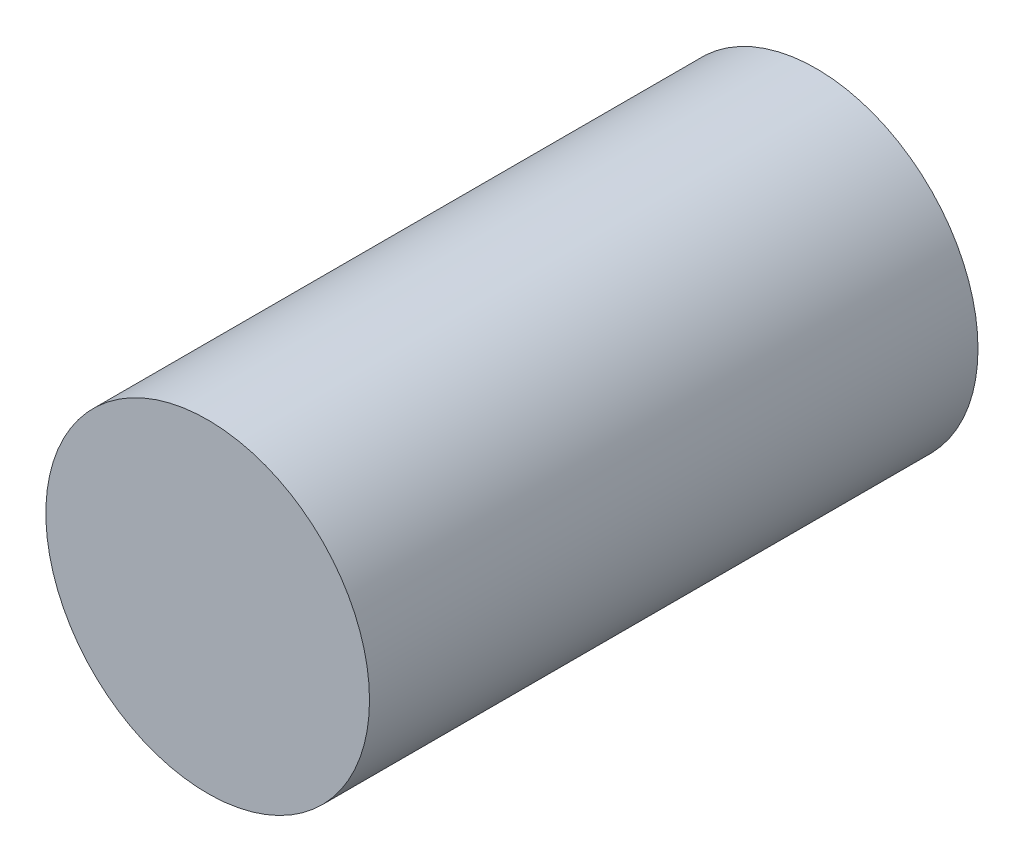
ISO-10303-21;
HEADER;
FILE_DESCRIPTION(('STEP AP214'),'2;1');
FILE_NAME('part.step','',(''),(''),'','','');
FILE_SCHEMA(('AUTOMOTIVE_DESIGN { 1 0 10303 214 1 1 1 1 }'));
ENDSEC;
DATA;
#1=APPLICATION_CONTEXT('core data for automotive mechanical design processes');
#2=APPLICATION_PROTOCOL_DEFINITION('international standard','automotive_design',2000,#1);
#3=PRODUCT_CONTEXT('',#1,'mechanical');
#4=PRODUCT('Part','Part','',(#3));
#5=PRODUCT_RELATED_PRODUCT_CATEGORY('part','',(#4));
#6=PRODUCT_DEFINITION_FORMATION('','',#4);
#7=PRODUCT_DEFINITION_CONTEXT('part definition',#1,'design');
#8=PRODUCT_DEFINITION('design','',#6,#7);
#9=PRODUCT_DEFINITION_SHAPE('','',#8);
#10=(LENGTH_UNIT() NAMED_UNIT(*) SI_UNIT(.MILLI.,.METRE.));
#11=(NAMED_UNIT(*) PLANE_ANGLE_UNIT() SI_UNIT($,.RADIAN.));
#12=(NAMED_UNIT(*) SI_UNIT($,.STERADIAN.) SOLID_ANGLE_UNIT());
#13=UNCERTAINTY_MEASURE_WITH_UNIT(LENGTH_MEASURE(1.E-05),#10,'distance_accuracy_value','');
#14=(GEOMETRIC_REPRESENTATION_CONTEXT(3) GLOBAL_UNCERTAINTY_ASSIGNED_CONTEXT((#13)) GLOBAL_UNIT_ASSIGNED_CONTEXT((#10,
#11,#12)) REPRESENTATION_CONTEXT('',''));
#15=CARTESIAN_POINT('',(0.,0.,0.));
#16=DIRECTION('',(0.,0.,1.));
#17=DIRECTION('',(1.,0.,0.));
#18=AXIS2_PLACEMENT_3D('',#15,#16,#17);
#19=CARTESIAN_POINT('',(0.,0.,141.));
#20=DIRECTION('',(0.,0.,-1.));
#21=DIRECTION('',(-1.,0.,0.));
#22=AXIS2_PLACEMENT_3D('',#19,#20,#21);
#23=CYLINDRICAL_SURFACE('',#22,37.5);
#24=CARTESIAN_POINT('',(0.,0.,141.));
#25=DIRECTION('',(0.,0.,1.));
#26=DIRECTION('',(1.,0.,0.));
#27=AXIS2_PLACEMENT_3D('',#24,#25,#26);
#28=CIRCLE('',#27,37.5);
#29=CARTESIAN_POINT('',(37.5,0.,141.));
#30=VERTEX_POINT('',#29);
#31=EDGE_CURVE('E10',#30,#30,#28,.T.);
#32=ORIENTED_EDGE('',*,*,#31,.F.);
#33=EDGE_LOOP('',(#32));
#34=FACE_BOUND('',#33,.T.);
#35=CARTESIAN_POINT('',(0.,0.,0.));
#36=DIRECTION('',(0.,0.,1.));
#37=DIRECTION('',(1.,0.,0.));
#38=AXIS2_PLACEMENT_3D('',#35,#36,#37);
#39=CIRCLE('',#38,37.5);
#40=CARTESIAN_POINT('',(37.5,0.,0.));
#41=VERTEX_POINT('',#40);
#42=EDGE_CURVE('E38',#41,#41,#39,.T.);
#43=ORIENTED_EDGE('',*,*,#42,.T.);
#44=EDGE_LOOP('',(#43));
#45=FACE_BOUND('',#44,.T.);
#46=ADVANCED_FACE('F35',(#34,#45),#23,.T.);
#47=CARTESIAN_POINT('',(0.,0.,141.));
#48=DIRECTION('',(0.,0.,1.));
#49=DIRECTION('',(1.,0.,0.));
#50=AXIS2_PLACEMENT_3D('',#47,#48,#49);
#51=PLANE('',#50);
#52=ORIENTED_EDGE('',*,*,#31,.T.);
#53=EDGE_LOOP('',(#52));
#54=FACE_BOUND('',#53,.T.);
#55=ADVANCED_FACE('F50',(#54),#51,.T.);
#56=CARTESIAN_POINT('',(0.,0.,0.));
#57=DIRECTION('',(0.,0.,1.));
#58=DIRECTION('',(1.,0.,0.));
#59=AXIS2_PLACEMENT_3D('',#56,#57,#58);
#60=PLANE('',#59);
#61=ORIENTED_EDGE('',*,*,#42,.F.);
#62=EDGE_LOOP('',(#61));
#63=FACE_BOUND('',#62,.T.);
#64=ADVANCED_FACE('F48',(#63),#60,.F.);
#65=CLOSED_SHELL('',(#46,#55,#64));
#66=MANIFOLD_SOLID_BREP('B2',#65);
#67=ADVANCED_BREP_SHAPE_REPRESENTATION('',(#18,#66),#14);
#68=SHAPE_DEFINITION_REPRESENTATION(#9,#67);
ENDSEC;
END-ISO-10303-21;
